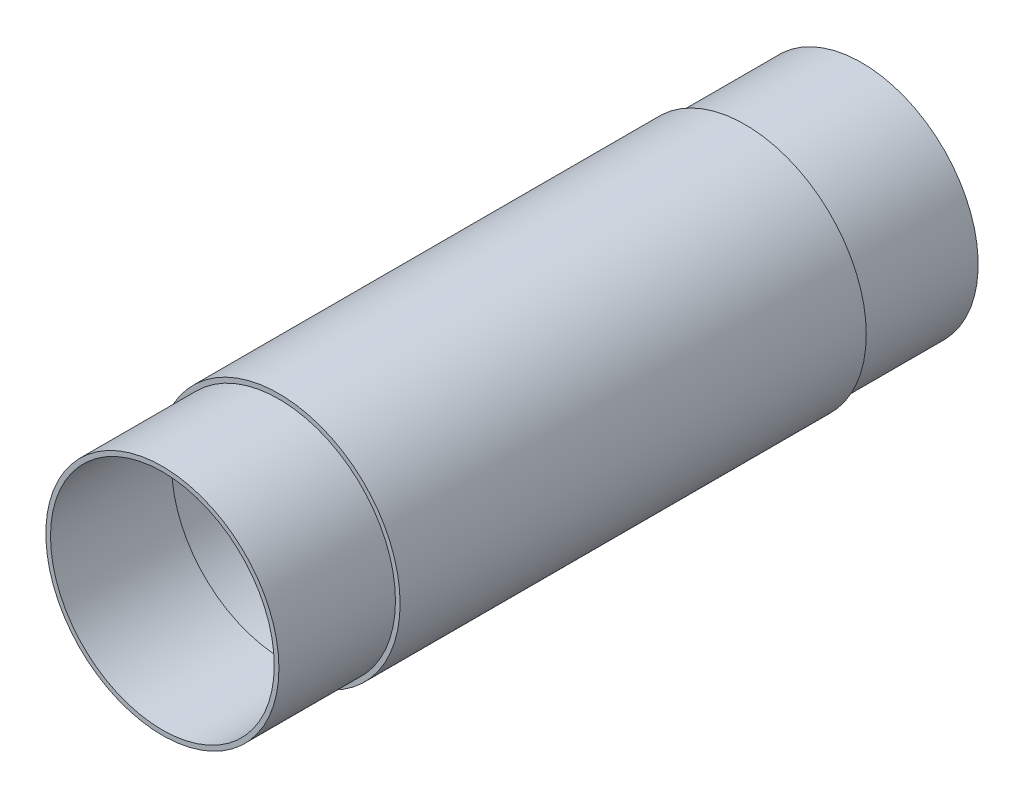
ISO-10303-21;
HEADER;
FILE_DESCRIPTION(('STEP AP214'),'2;1');
FILE_NAME('part.step','',(''),(''),'','','');
FILE_SCHEMA(('AUTOMOTIVE_DESIGN { 1 0 10303 214 1 1 1 1 }'));
ENDSEC;
DATA;
#1=APPLICATION_CONTEXT('core data for automotive mechanical design processes');
#2=APPLICATION_PROTOCOL_DEFINITION('international standard','automotive_design',2000,#1);
#3=PRODUCT_CONTEXT('',#1,'mechanical');
#4=PRODUCT('Part','Part','',(#3));
#5=PRODUCT_RELATED_PRODUCT_CATEGORY('part','',(#4));
#6=PRODUCT_DEFINITION_FORMATION('','',#4);
#7=PRODUCT_DEFINITION_CONTEXT('part definition',#1,'design');
#8=PRODUCT_DEFINITION('design','',#6,#7);
#9=PRODUCT_DEFINITION_SHAPE('','',#8);
#10=(LENGTH_UNIT() NAMED_UNIT(*) SI_UNIT(.MILLI.,.METRE.));
#11=(NAMED_UNIT(*) PLANE_ANGLE_UNIT() SI_UNIT($,.RADIAN.));
#12=(NAMED_UNIT(*) SI_UNIT($,.STERADIAN.) SOLID_ANGLE_UNIT());
#13=UNCERTAINTY_MEASURE_WITH_UNIT(LENGTH_MEASURE(1.E-05),#10,'distance_accuracy_value','');
#14=(GEOMETRIC_REPRESENTATION_CONTEXT(3) GLOBAL_UNCERTAINTY_ASSIGNED_CONTEXT((#13)) GLOBAL_UNIT_ASSIGNED_CONTEXT((#10,
#11,#12)) REPRESENTATION_CONTEXT('',''));
#15=CARTESIAN_POINT('',(0.,0.,0.));
#16=DIRECTION('',(0.,0.,1.));
#17=DIRECTION('',(1.,0.,0.));
#18=AXIS2_PLACEMENT_3D('',#15,#16,#17);
#19=CARTESIAN_POINT('',(0.,0.,75.));
#20=DIRECTION('',(0.,0.,1.));
#21=DIRECTION('',(1.,0.,0.));
#22=AXIS2_PLACEMENT_3D('',#19,#20,#21);
#23=PLANE('',#22);
#24=CARTESIAN_POINT('',(0.,0.,75.));
#25=DIRECTION('',(0.,0.,1.));
#26=DIRECTION('',(1.,0.,0.));
#27=AXIS2_PLACEMENT_3D('',#24,#25,#26);
#28=CIRCLE('',#27,25.);
#29=CARTESIAN_POINT('',(25.,0.,75.));
#30=VERTEX_POINT('',#29);
#31=EDGE_CURVE('E11',#30,#30,#28,.T.);
#32=ORIENTED_EDGE('',*,*,#31,.T.);
#33=EDGE_LOOP('',(#32));
#34=FACE_BOUND('',#33,.T.);
#35=CARTESIAN_POINT('',(0.,0.,75.));
#36=DIRECTION('',(0.,0.,1.));
#37=DIRECTION('',(1.,0.,0.));
#38=AXIS2_PLACEMENT_3D('',#35,#36,#37);
#39=CIRCLE('',#38,24.);
#40=CARTESIAN_POINT('',(24.,0.,75.));
#41=VERTEX_POINT('',#40);
#42=EDGE_CURVE('E53',#41,#41,#39,.T.);
#43=ORIENTED_EDGE('',*,*,#42,.F.);
#44=EDGE_LOOP('',(#43));
#45=FACE_BOUND('',#44,.T.);
#46=ADVANCED_FACE('F46',(#34,#45),#23,.T.);
#47=CARTESIAN_POINT('',(0.,0.,75.));
#48=DIRECTION('',(0.,0.,-1.));
#49=DIRECTION('',(-1.,0.,0.));
#50=AXIS2_PLACEMENT_3D('',#47,#48,#49);
#51=CYLINDRICAL_SURFACE('',#50,25.);
#52=ORIENTED_EDGE('',*,*,#31,.F.);
#53=EDGE_LOOP('',(#52));
#54=FACE_BOUND('',#53,.T.);
#55=CARTESIAN_POINT('',(0.,0.,49.));
#56=DIRECTION('',(0.,0.,1.));
#57=DIRECTION('',(1.,0.,0.));
#58=AXIS2_PLACEMENT_3D('',#55,#56,#57);
#59=CIRCLE('',#58,25.);
#60=CARTESIAN_POINT('',(25.,0.,49.));
#61=VERTEX_POINT('',#60);
#62=EDGE_CURVE('E57',#61,#61,#59,.T.);
#63=ORIENTED_EDGE('',*,*,#62,.T.);
#64=EDGE_LOOP('',(#63));
#65=FACE_BOUND('',#64,.T.);
#66=ADVANCED_FACE('F48',(#54,#65),#51,.T.);
#67=CARTESIAN_POINT('',(0.,0.,75.));
#68=DIRECTION('',(0.,0.,-1.));
#69=DIRECTION('',(-1.,0.,0.));
#70=AXIS2_PLACEMENT_3D('',#67,#68,#69);
#71=CYLINDRICAL_SURFACE('',#70,24.);
#72=ORIENTED_EDGE('',*,*,#42,.T.);
#73=EDGE_LOOP('',(#72));
#74=FACE_BOUND('',#73,.T.);
#75=CARTESIAN_POINT('',(0.,0.,49.));
#76=DIRECTION('',(0.,0.,1.));
#77=DIRECTION('',(1.,0.,0.));
#78=AXIS2_PLACEMENT_3D('',#75,#76,#77);
#79=CIRCLE('',#78,24.);
#80=CARTESIAN_POINT('',(24.,0.,49.));
#81=VERTEX_POINT('',#80);
#82=EDGE_CURVE('E61',#81,#81,#79,.T.);
#83=ORIENTED_EDGE('',*,*,#82,.F.);
#84=EDGE_LOOP('',(#83));
#85=FACE_BOUND('',#84,.T.);
#86=ADVANCED_FACE('F70',(#74,#85),#71,.F.);
#87=CARTESIAN_POINT('',(0.,0.,49.));
#88=DIRECTION('',(0.,0.,1.));
#89=DIRECTION('',(1.,0.,0.));
#90=AXIS2_PLACEMENT_3D('',#87,#88,#89);
#91=PLANE('',#90);
#92=ORIENTED_EDGE('',*,*,#82,.T.);
#93=EDGE_LOOP('',(#92));
#94=FACE_BOUND('',#93,.T.);
#95=ORIENTED_EDGE('',*,*,#62,.F.);
#96=EDGE_LOOP('',(#95));
#97=FACE_BOUND('',#96,.T.);
#98=ADVANCED_FACE('F67',(#94,#97),#91,.F.);
#99=CLOSED_SHELL('',(#46,#66,#86,#98));
#100=MANIFOLD_SOLID_BREP('B2',#99);
#101=CARTESIAN_POINT('',(0.,0.,-75.));
#102=DIRECTION('',(0.,0.,-1.));
#103=DIRECTION('',(-1.,0.,0.));
#104=AXIS2_PLACEMENT_3D('',#101,#102,#103);
#105=PLANE('',#104);
#106=CARTESIAN_POINT('',(0.,0.,-75.));
#107=DIRECTION('',(0.,0.,-1.));
#108=DIRECTION('',(-1.,0.,0.));
#109=AXIS2_PLACEMENT_3D('',#106,#107,#108);
#110=CIRCLE('',#109,25.);
#111=CARTESIAN_POINT('',(-25.,0.,-75.));
#112=VERTEX_POINT('',#111);
#113=EDGE_CURVE('E45',#112,#112,#110,.T.);
#114=ORIENTED_EDGE('',*,*,#113,.T.);
#115=EDGE_LOOP('',(#114));
#116=FACE_BOUND('',#115,.T.);
#117=CARTESIAN_POINT('',(0.,0.,-75.));
#118=DIRECTION('',(0.,0.,-1.));
#119=DIRECTION('',(-1.,0.,0.));
#120=AXIS2_PLACEMENT_3D('',#117,#118,#119);
#121=CIRCLE('',#120,24.);
#122=CARTESIAN_POINT('',(-24.,0.,-75.));
#123=VERTEX_POINT('',#122);
#124=EDGE_CURVE('E122',#123,#123,#121,.T.);
#125=ORIENTED_EDGE('',*,*,#124,.F.);
#126=EDGE_LOOP('',(#125));
#127=FACE_BOUND('',#126,.T.);
#128=ADVANCED_FACE('F115',(#116,#127),#105,.T.);
#129=CARTESIAN_POINT('',(0.,0.,-75.));
#130=DIRECTION('',(0.,0.,1.));
#131=DIRECTION('',(1.,0.,0.));
#132=AXIS2_PLACEMENT_3D('',#129,#130,#131);
#133=CYLINDRICAL_SURFACE('',#132,25.);
#134=ORIENTED_EDGE('',*,*,#113,.F.);
#135=EDGE_LOOP('',(#134));
#136=FACE_BOUND('',#135,.T.);
#137=CARTESIAN_POINT('',(0.,0.,-49.));
#138=DIRECTION('',(0.,0.,-1.));
#139=DIRECTION('',(-1.,0.,0.));
#140=AXIS2_PLACEMENT_3D('',#137,#138,#139);
#141=CIRCLE('',#140,25.);
#142=CARTESIAN_POINT('',(-25.,0.,-49.));
#143=VERTEX_POINT('',#142);
#144=EDGE_CURVE('E126',#143,#143,#141,.T.);
#145=ORIENTED_EDGE('',*,*,#144,.T.);
#146=EDGE_LOOP('',(#145));
#147=FACE_BOUND('',#146,.T.);
#148=ADVANCED_FACE('F117',(#136,#147),#133,.T.);
#149=CARTESIAN_POINT('',(0.,0.,-75.));
#150=DIRECTION('',(0.,0.,1.));
#151=DIRECTION('',(1.,0.,0.));
#152=AXIS2_PLACEMENT_3D('',#149,#150,#151);
#153=CYLINDRICAL_SURFACE('',#152,24.);
#154=ORIENTED_EDGE('',*,*,#124,.T.);
#155=EDGE_LOOP('',(#154));
#156=FACE_BOUND('',#155,.T.);
#157=CARTESIAN_POINT('',(0.,0.,-49.));
#158=DIRECTION('',(0.,0.,-1.));
#159=DIRECTION('',(-1.,0.,0.));
#160=AXIS2_PLACEMENT_3D('',#157,#158,#159);
#161=CIRCLE('',#160,24.);
#162=CARTESIAN_POINT('',(-24.,0.,-49.));
#163=VERTEX_POINT('',#162);
#164=EDGE_CURVE('E130',#163,#163,#161,.T.);
#165=ORIENTED_EDGE('',*,*,#164,.F.);
#166=EDGE_LOOP('',(#165));
#167=FACE_BOUND('',#166,.T.);
#168=ADVANCED_FACE('F139',(#156,#167),#153,.F.);
#169=CARTESIAN_POINT('',(0.,0.,-49.));
#170=DIRECTION('',(0.,0.,-1.));
#171=DIRECTION('',(-1.,0.,0.));
#172=AXIS2_PLACEMENT_3D('',#169,#170,#171);
#173=PLANE('',#172);
#174=ORIENTED_EDGE('',*,*,#164,.T.);
#175=EDGE_LOOP('',(#174));
#176=FACE_BOUND('',#175,.T.);
#177=ORIENTED_EDGE('',*,*,#144,.F.);
#178=EDGE_LOOP('',(#177));
#179=FACE_BOUND('',#178,.T.);
#180=ADVANCED_FACE('F136',(#176,#179),#173,.F.);
#181=CLOSED_SHELL('',(#128,#148,#168,#180));
#182=MANIFOLD_SOLID_BREP('B6',#181);
#183=CARTESIAN_POINT('',(0.,0.,50.));
#184=DIRECTION('',(0.,0.,1.));
#185=DIRECTION('',(1.,0.,0.));
#186=AXIS2_PLACEMENT_3D('',#183,#184,#185);
#187=PLANE('',#186);
#188=CARTESIAN_POINT('',(0.,0.,50.));
#189=DIRECTION('',(0.,0.,1.));
#190=DIRECTION('',(1.,0.,0.));
#191=AXIS2_PLACEMENT_3D('',#188,#189,#190);
#192=CIRCLE('',#191,26.);
#193=CARTESIAN_POINT('',(26.,0.,50.));
#194=VERTEX_POINT('',#193);
#195=EDGE_CURVE('E114',#194,#194,#192,.T.);
#196=ORIENTED_EDGE('',*,*,#195,.T.);
#197=EDGE_LOOP('',(#196));
#198=FACE_BOUND('',#197,.T.);
#199=CARTESIAN_POINT('',(0.,0.,50.));
#200=DIRECTION('',(0.,0.,1.));
#201=DIRECTION('',(1.,0.,0.));
#202=AXIS2_PLACEMENT_3D('',#199,#200,#201);
#203=CIRCLE('',#202,25.);
#204=CARTESIAN_POINT('',(25.,0.,50.));
#205=VERTEX_POINT('',#204);
#206=EDGE_CURVE('E185',#205,#205,#203,.T.);
#207=ORIENTED_EDGE('',*,*,#206,.F.);
#208=EDGE_LOOP('',(#207));
#209=FACE_BOUND('',#208,.T.);
#210=ADVANCED_FACE('F177',(#198,#209),#187,.T.);
#211=CARTESIAN_POINT('',(0.,0.,50.));
#212=DIRECTION('',(0.,0.,-1.));
#213=DIRECTION('',(-1.,0.,0.));
#214=AXIS2_PLACEMENT_3D('',#211,#212,#213);
#215=CYLINDRICAL_SURFACE('',#214,26.);
#216=ORIENTED_EDGE('',*,*,#195,.F.);
#217=EDGE_LOOP('',(#216));
#218=FACE_BOUND('',#217,.T.);
#219=CARTESIAN_POINT('',(0.,0.,-50.));
#220=DIRECTION('',(0.,0.,1.));
#221=DIRECTION('',(1.,0.,0.));
#222=AXIS2_PLACEMENT_3D('',#219,#220,#221);
#223=CIRCLE('',#222,26.);
#224=CARTESIAN_POINT('',(26.,0.,-50.));
#225=VERTEX_POINT('',#224);
#226=EDGE_CURVE('E190',#225,#225,#223,.T.);
#227=ORIENTED_EDGE('',*,*,#226,.T.);
#228=EDGE_LOOP('',(#227));
#229=FACE_BOUND('',#228,.T.);
#230=ADVANCED_FACE('F179',(#218,#229),#215,.T.);
#231=CARTESIAN_POINT('',(0.,0.,50.));
#232=DIRECTION('',(0.,0.,-1.));
#233=DIRECTION('',(-1.,0.,0.));
#234=AXIS2_PLACEMENT_3D('',#231,#232,#233);
#235=CYLINDRICAL_SURFACE('',#234,25.);
#236=ORIENTED_EDGE('',*,*,#206,.T.);
#237=EDGE_LOOP('',(#236));
#238=FACE_BOUND('',#237,.T.);
#239=CARTESIAN_POINT('',(0.,0.,-50.));
#240=DIRECTION('',(0.,0.,1.));
#241=DIRECTION('',(1.,0.,0.));
#242=AXIS2_PLACEMENT_3D('',#239,#240,#241);
#243=CIRCLE('',#242,25.);
#244=CARTESIAN_POINT('',(25.,0.,-50.));
#245=VERTEX_POINT('',#244);
#246=EDGE_CURVE('E195',#245,#245,#243,.T.);
#247=ORIENTED_EDGE('',*,*,#246,.F.);
#248=EDGE_LOOP('',(#247));
#249=FACE_BOUND('',#248,.T.);
#250=ADVANCED_FACE('F205',(#238,#249),#235,.F.);
#251=CARTESIAN_POINT('',(0.,0.,-50.));
#252=DIRECTION('',(0.,0.,1.));
#253=DIRECTION('',(1.,0.,0.));
#254=AXIS2_PLACEMENT_3D('',#251,#252,#253);
#255=PLANE('',#254);
#256=ORIENTED_EDGE('',*,*,#246,.T.);
#257=EDGE_LOOP('',(#256));
#258=FACE_BOUND('',#257,.T.);
#259=ORIENTED_EDGE('',*,*,#226,.F.);
#260=EDGE_LOOP('',(#259));
#261=FACE_BOUND('',#260,.T.);
#262=ADVANCED_FACE('F202',(#258,#261),#255,.F.);
#263=CLOSED_SHELL('',(#210,#230,#250,#262));
#264=MANIFOLD_SOLID_BREP('B40',#263);
#265=ADVANCED_BREP_SHAPE_REPRESENTATION('',(#18,#100,#182,#264),#14);
#266=SHAPE_DEFINITION_REPRESENTATION(#9,#265);
ENDSEC;
END-ISO-10303-21;
